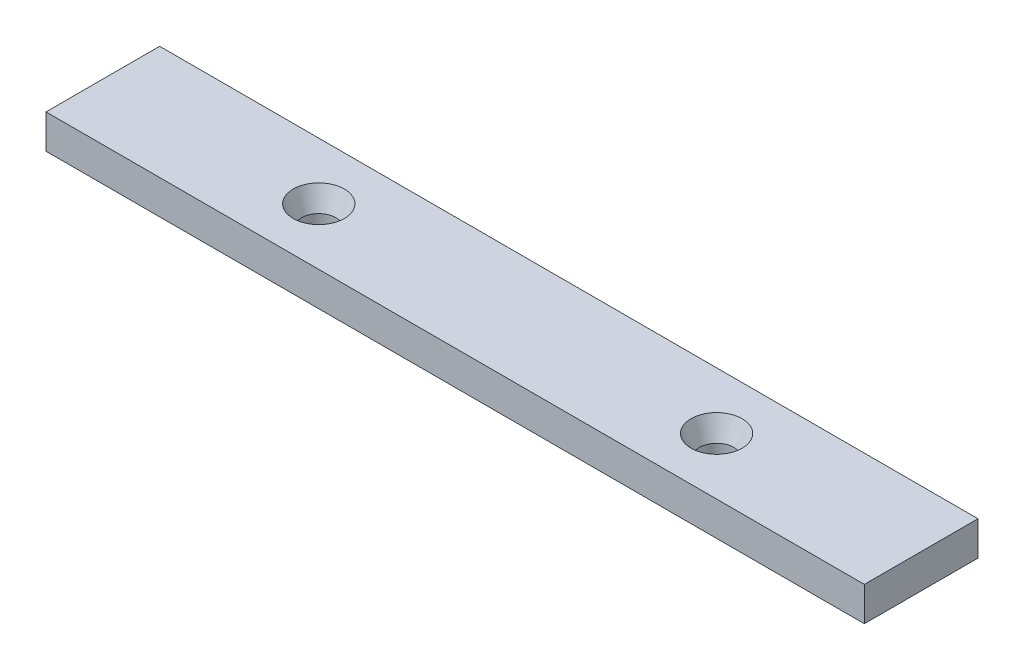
from build123d import *

# Parameters (mm, degrees)
SKETCH1_W       = 144
SKETCH1_H       = 20
EXTRUDE1_DEPTH  = 6
LPATTERN2_COUNT = 2
LPATTERN2_PITCH = 70


with BuildPart() as part:
    # Sketch1 → Extrude1 (new body)
    with BuildSketch(Plane(origin=(0, 0, 0), x_dir=(1, 0, 0), z_dir=(0, 1, 0))):
        Rectangle(SKETCH1_W, SKETCH1_H)
    extrude(amount=EXTRUDE1_DEPTH)

    # Sketch3 → CSK for M6 Flat Head Machine Screw1 (revolve, cut)
    with BuildSketch(Plane(origin=(-34, 6, 0), x_dir=(0, 0, 1), z_dir=(1, 0, 0))):
        Polygon((0, 0), (0, 6), (3, 6), (3, 3.621320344), (4.5, 0), align=None)
    csk_for_m6_flat_head_machine_screw1 = revolve(axis=Axis((-34, 12.35, 0), (0, -1, 0)), mode=Mode.SUBTRACT)

    # LPattern2: CSK for M6 Flat Head Machine Screw1 ×2
    with Locations(*[(i * LPATTERN2_PITCH, 0, 0) for i in range(1, LPATTERN2_COUNT)]):
        add(csk_for_m6_flat_head_machine_screw1, mode=Mode.SUBTRACT)


solid = part.part
